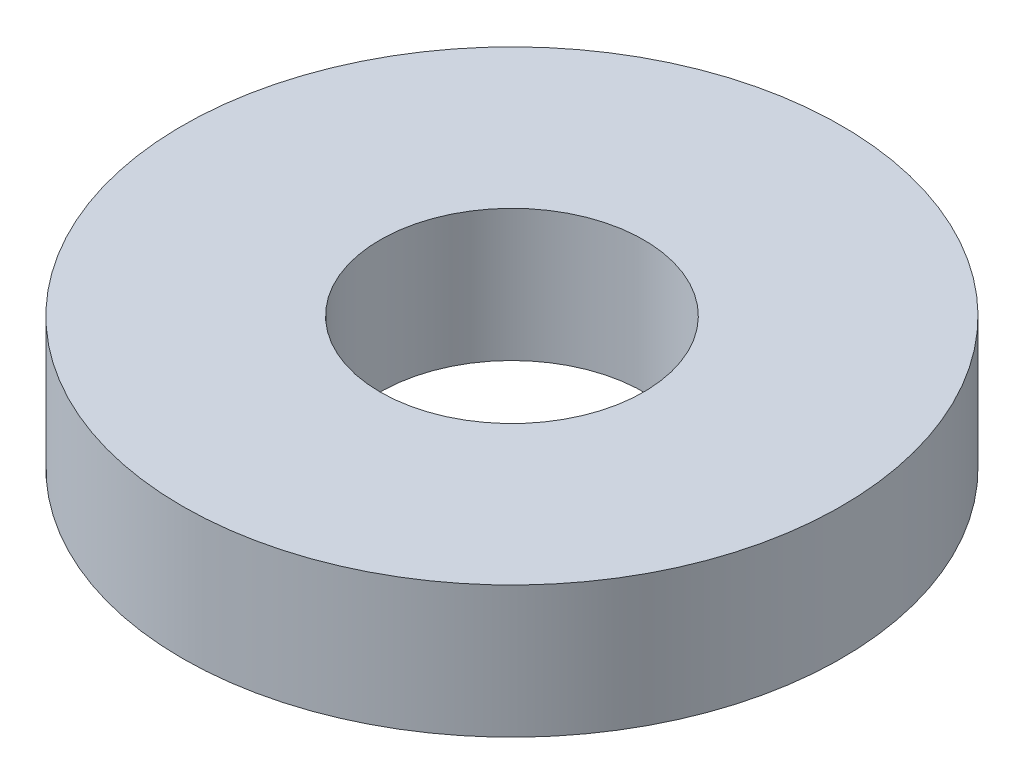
from build123d import *

# Parameters (mm, degrees)
ESQUISSE1_R      = 7.5
ESQUISSE1_R_2    = 3
EXTRUSION1_DEPTH = 3


with BuildPart() as part:
    # Esquisse1 → Extrusion1 (new body)
    with BuildSketch(Plane(origin=(0, 0, 0), x_dir=(1, 0, 0), z_dir=(0, 1, 0))):
        with Locations(Location((0, 0, 0), (0, 0, 270))):
            Circle(ESQUISSE1_R)
        with Locations(Location((0, 0, 0), (0, 0, 270))):
            Circle(ESQUISSE1_R_2, mode=Mode.SUBTRACT)
    extrude(amount=EXTRUSION1_DEPTH)


solid = part.part
